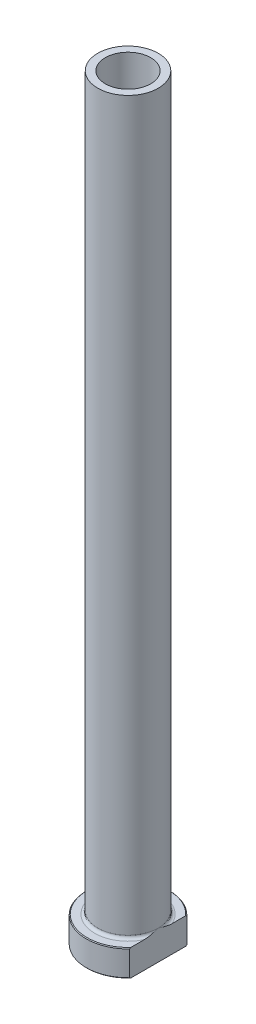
from build123d import *

# Parameters (mm, degrees)
FILLET1_R          = 0.8
CHAMFER1_SIZE      = 0.2
CUT_EXTRUDE1_DEPTH = 201.604087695
CHAMFER2_SIZE      = 0.5


with BuildPart() as part:
    # Sketch1 → Revolve1 (revolve)
    with BuildSketch(Plane.XY, mode=Mode.PRIVATE) as revolve1_sk:
        Polygon((-6, 200), (-8, 200), (-8, 7), (-11, 7), (-11, 0), (-6.25, 0), (-6.25, 133), (-6, 145), align=None)
    revolve(revolve1_sk.sketch.rotate(Axis((0, 92.187680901, 0), (0, -1, 0)), 270), axis=Axis((0, 92.187680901, 0), (0, -1, 0)))

    # Fillet1
    fillet1_edges = [part.edges().sort_by_distance(p)[0] for p in [
        (0, 7, -8),
    ]]
    fillet(fillet1_edges, radius=FILLET1_R)

    # Chamfer1
    chamfer1_edges = [part.edges().sort_by_distance(p)[0] for p in [
        (0, 0, -11),
        (0, 7, -11),
    ]]
    chamfer(chamfer1_edges, length=CHAMFER1_SIZE)

    # Sketch2 → Cut-Extrude1 (cut, through all)
    with BuildSketch(Plane.XZ):
        with BuildLine():
            Line((8, 7.549834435), (8, -7.549834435))
            ThreePointArc((8, -7.549834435), (11, 0), (8, 7.549834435))
        make_face()
    extrude(amount=-CUT_EXTRUDE1_DEPTH, mode=Mode.SUBTRACT)

    # Chamfer2
    chamfer2_edges = [part.edges().sort_by_distance(p)[0] for p in [
        (0, 0, -6.25),
    ]]
    chamfer(chamfer2_edges, length=CHAMFER2_SIZE)


solid = part.part
